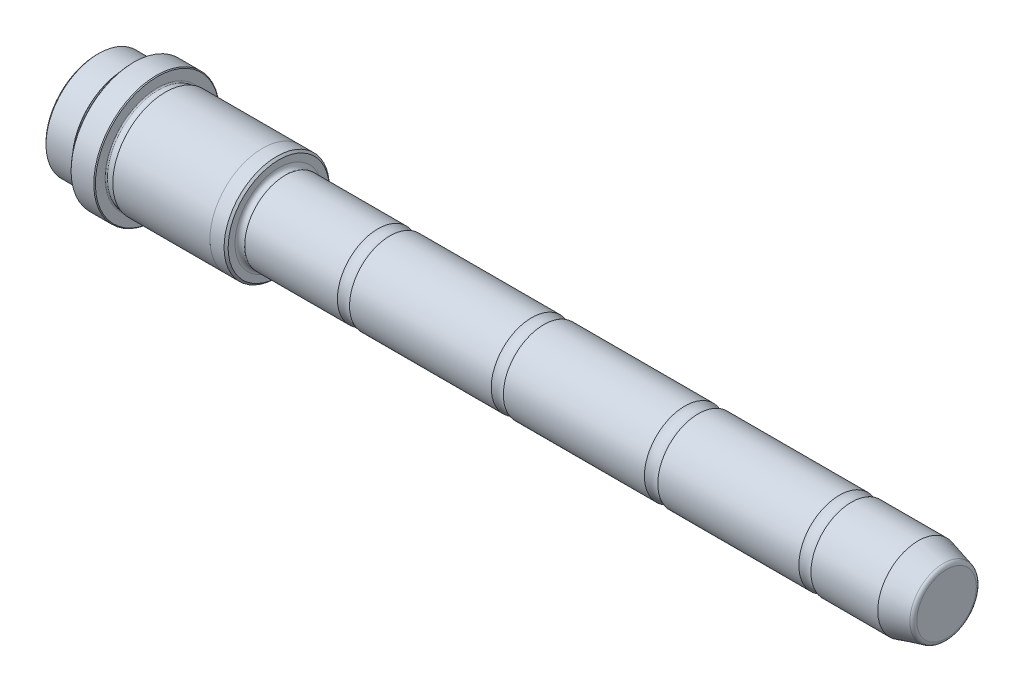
from build123d import *

# Parameters (mm, degrees)
FILLET1_R     = 1
CHAMFER1_SIZE = 0.2
CHAMFER2_SIZE = 0.5


with BuildPart() as part:
    # Sketch1 → Revolve1 (revolve)
    with BuildSketch(Plane.XY):
        with BuildLine():
            Line((165, 8.124355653), (158, 10))
            Line((158, 10), (1.6, 10))
            ThreePointArc((1.6, 10), (0.552786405, 9.905572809), (0, 10.8))
            Line((0, 10.8), (0, 13))
            Line((0, 13), (-4, 13))
            Line((-4, 13), (-28, 13.0001))
            Line((-28, 13.0001), (-28, 12.9))
            ThreePointArc((-28, 12.9), (-28.087867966, 12.687867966), (-28.3, 12.6))
            Line((-28.3, 12.6), (-29.7, 12.6))
            ThreePointArc((-29.7, 12.6), (-29.912132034, 12.687867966), (-30, 12.9))
            Line((-30, 12.9), (-30, 15.5))
            Line((-30, 15.5), (-36, 15.5))
            Line((-36, 15.5), (-36, 12.9))
            ThreePointArc((-36, 12.9), (-36.087867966, 12.687867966), (-36.3, 12.6))
            Line((-36.3, 12.6), (-37.7, 12.6))
            ThreePointArc((-37.7, 12.6), (-37.912132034, 12.687867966), (-38, 12.9))
            Line((-38, 12.9), (-38, 13))
            Line((-38, 13), (-45, 13))
            Line((-45, 13), (-45, 0))
            Line((-45, 0), (165, 0))
            Line((165, 0), (165, 8.124355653))
        make_face()
    revolve(axis=Axis((165, 0, 0), (-1, 0, 0)))

    # Sketch2 → Groove A (revolve, cut)
    with BuildSketch(Plane.XY):
        with BuildLine():
            Line((138.503337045, 10), (141.496662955, 10))
            ThreePointArc((141.496662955, 10), (140, 9.6), (138.503337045, 10))
        make_face()
    revolve(axis=Axis((165, 0, 0), (1, 0, 0)), mode=Mode.SUBTRACT)

    # Sketch3 → Groove B (revolve, cut)
    with BuildSketch(Plane.XY, mode=Mode.PRIVATE) as groove_b_sk:
        with BuildLine():
            Line((100.341687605, 10), (103.658312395, 10))
            ThreePointArc((103.658312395, 10), (102, 9.5), (100.341687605, 10))
        make_face()
    revolve(groove_b_sk.sketch.rotate(Axis((165, 0, 0), (1, 0, 0)), 180), axis=Axis((165, 0, 0), (1, 0, 0)), mode=Mode.SUBTRACT)

    # Sketch4 → Groove C (revolve, cut)
    with BuildSketch(Plane.XY, mode=Mode.PRIVATE) as groove_c_sk:
        with BuildLine():
            Line((62.503337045, 10), (65.496662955, 10))
            ThreePointArc((65.496662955, 10), (64, 9.6), (62.503337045, 10))
        make_face()
    revolve(groove_c_sk.sketch.rotate(Axis((165, 0, 0), (1, 0, 0)), 180), axis=Axis((165, 0, 0), (1, 0, 0)), mode=Mode.SUBTRACT)

    # Sketch5 → Groove D (revolve, cut)
    with BuildSketch(Plane.XY, mode=Mode.PRIVATE) as groove_d_sk:
        with BuildLine():
            Line((24.503337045, 10), (27.496662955, 10))
            ThreePointArc((27.496662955, 10), (26, 9.6), (24.503337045, 10))
        make_face()
    revolve(groove_d_sk.sketch.rotate(Axis((165, 0, 0), (1, 0, 0)), 180), axis=Axis((165, 0, 0), (1, 0, 0)), mode=Mode.SUBTRACT)

    # Fillet1
    fillet1_edges = [part.edges().sort_by_distance(p)[0] for p in [
        (165, -8.124355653, 0),
    ]]
    fillet(fillet1_edges, radius=FILLET1_R)

    # Chamfer1
    chamfer1_edges = [part.edges().sort_by_distance(p)[0] for p in [
        (-30, -15.5, 0),
        (-36, -15.5, 0),
    ]]
    chamfer(chamfer1_edges, length=CHAMFER1_SIZE)

    # Chamfer2
    chamfer2_edges = [part.edges().sort_by_distance(p)[0] for p in [
        (0, -13, 0),
        (-45, -13, 0),
    ]]
    chamfer(chamfer2_edges, length=CHAMFER2_SIZE)


solid = part.part
